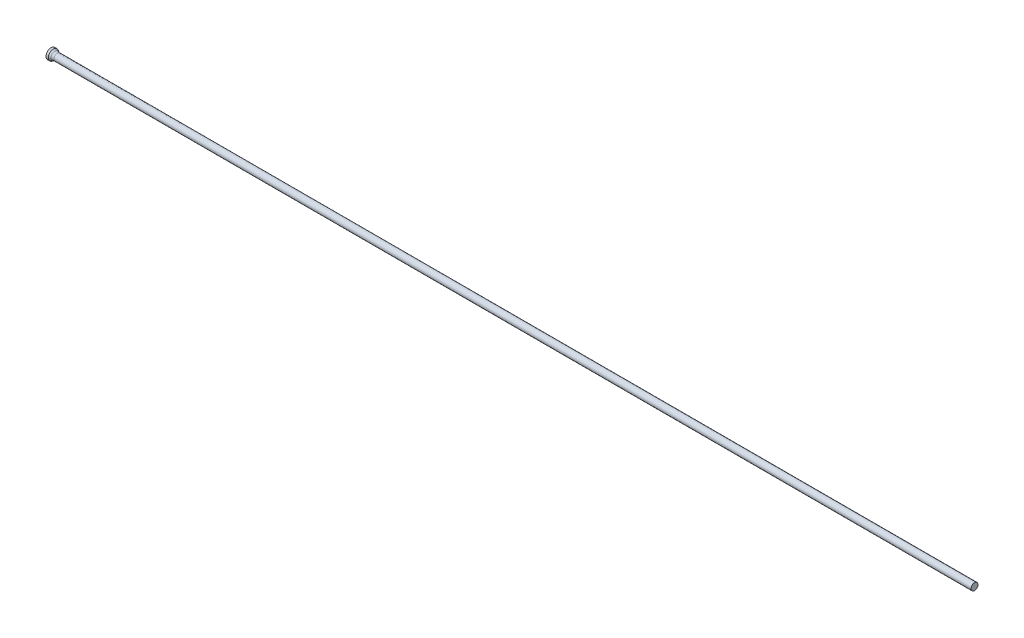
ISO-10303-21;
HEADER;
FILE_DESCRIPTION(('STEP AP214'),'2;1');
FILE_NAME('part.step','',(''),(''),'','','');
FILE_SCHEMA(('AUTOMOTIVE_DESIGN { 1 0 10303 214 1 1 1 1 }'));
ENDSEC;
DATA;
#1=APPLICATION_CONTEXT('core data for automotive mechanical design processes');
#2=APPLICATION_PROTOCOL_DEFINITION('international standard','automotive_design',2000,#1);
#3=PRODUCT_CONTEXT('',#1,'mechanical');
#4=PRODUCT('Part','Part','',(#3));
#5=PRODUCT_RELATED_PRODUCT_CATEGORY('part','',(#4));
#6=PRODUCT_DEFINITION_FORMATION('','',#4);
#7=PRODUCT_DEFINITION_CONTEXT('part definition',#1,'design');
#8=PRODUCT_DEFINITION('design','',#6,#7);
#9=PRODUCT_DEFINITION_SHAPE('','',#8);
#10=(LENGTH_UNIT() NAMED_UNIT(*) SI_UNIT(.MILLI.,.METRE.));
#11=(NAMED_UNIT(*) PLANE_ANGLE_UNIT() SI_UNIT($,.RADIAN.));
#12=(NAMED_UNIT(*) SI_UNIT($,.STERADIAN.) SOLID_ANGLE_UNIT());
#13=UNCERTAINTY_MEASURE_WITH_UNIT(LENGTH_MEASURE(1.E-05),#10,'distance_accuracy_value','');
#14=(GEOMETRIC_REPRESENTATION_CONTEXT(3) GLOBAL_UNCERTAINTY_ASSIGNED_CONTEXT((#13)) GLOBAL_UNIT_ASSIGNED_CONTEXT((#10,
#11,#12)) REPRESENTATION_CONTEXT('',''));
#15=CARTESIAN_POINT('',(0.,0.,0.));
#16=DIRECTION('',(0.,0.,1.));
#17=DIRECTION('',(1.,0.,0.));
#18=AXIS2_PLACEMENT_3D('',#15,#16,#17);
#19=CARTESIAN_POINT('',(0.,0.,0.));
#20=DIRECTION('',(1.,0.,0.));
#21=DIRECTION('',(0.,0.,-1.));
#22=AXIS2_PLACEMENT_3D('',#19,#20,#21);
#23=PLANE('',#22);
#24=CARTESIAN_POINT('',(0.,0.,0.));
#25=DIRECTION('',(-1.,0.,0.));
#26=DIRECTION('',(0.,0.,1.));
#27=AXIS2_PLACEMENT_3D('',#24,#25,#26);
#28=CIRCLE('',#27,1.1);
#29=CARTESIAN_POINT('',(0.,0.,1.1));
#30=VERTEX_POINT('',#29);
#31=EDGE_CURVE('E25',#30,#30,#28,.T.);
#32=ORIENTED_EDGE('',*,*,#31,.T.);
#33=EDGE_LOOP('',(#32));
#34=FACE_BOUND('',#33,.T.);
#35=ADVANCED_FACE('F14',(#34),#23,.F.);
#36=CARTESIAN_POINT('',(0.,0.,0.));
#37=DIRECTION('',(-1.,0.,0.));
#38=DIRECTION('',(0.,0.,1.));
#39=AXIS2_PLACEMENT_3D('',#36,#37,#38);
#40=CYLINDRICAL_SURFACE('',#39,1.1);
#41=ORIENTED_EDGE('',*,*,#31,.F.);
#42=EDGE_LOOP('',(#41));
#43=FACE_BOUND('',#42,.T.);
#44=CARTESIAN_POINT('',(0.503782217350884,0.,0.));
#45=DIRECTION('',(-1.,0.,0.));
#46=DIRECTION('',(0.,0.,1.));
#47=AXIS2_PLACEMENT_3D('',#44,#45,#46);
#48=CIRCLE('',#47,1.1);
#49=CARTESIAN_POINT('',(0.503782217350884,0.,1.1));
#50=VERTEX_POINT('',#49);
#51=EDGE_CURVE('E29',#50,#50,#48,.T.);
#52=ORIENTED_EDGE('',*,*,#51,.T.);
#53=EDGE_LOOP('',(#52));
#54=FACE_BOUND('',#53,.T.);
#55=ADVANCED_FACE('F53',(#43,#54),#40,.T.);
#56=CARTESIAN_POINT('',(1.11,0.,0.));
#57=DIRECTION('',(-1.,0.,0.));
#58=DIRECTION('',(0.,0.,1.));
#59=AXIS2_PLACEMENT_3D('',#56,#57,#58);
#60=CONICAL_SURFACE('',#59,0.75,0.523598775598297);
#61=CARTESIAN_POINT('',(0.877949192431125,0.,0.));
#62=DIRECTION('',(-1.,0.,0.));
#63=DIRECTION('',(0.,0.,1.));
#64=AXIS2_PLACEMENT_3D('',#61,#62,#63);
#65=CIRCLE('',#64,0.883974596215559);
#66=CARTESIAN_POINT('',(0.877949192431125,0.,0.883974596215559));
#67=VERTEX_POINT('',#66);
#68=EDGE_CURVE('E21',#67,#67,#65,.T.);
#69=ORIENTED_EDGE('',*,*,#68,.T.);
#70=EDGE_LOOP('',(#69));
#71=FACE_BOUND('',#70,.T.);
#72=ORIENTED_EDGE('',*,*,#51,.F.);
#73=EDGE_LOOP('',(#72));
#74=FACE_BOUND('',#73,.T.);
#75=ADVANCED_FACE('F50',(#71,#74),#60,.T.);
#76=CARTESIAN_POINT('',(0.,0.,0.));
#77=DIRECTION('',(-1.,0.,0.));
#78=DIRECTION('',(0.,0.,1.));
#79=AXIS2_PLACEMENT_3D('',#76,#77,#78);
#80=CYLINDRICAL_SURFACE('',#79,0.75);
#81=CARTESIAN_POINT('',(1.37794919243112,0.,0.));
#82=DIRECTION('',(-1.,0.,0.));
#83=DIRECTION('',(0.,0.,1.));
#84=AXIS2_PLACEMENT_3D('',#81,#82,#83);
#85=CIRCLE('',#84,0.75);
#86=CARTESIAN_POINT('',(1.37794919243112,0.,0.75));
#87=VERTEX_POINT('',#86);
#88=EDGE_CURVE('E9',#87,#87,#85,.F.);
#89=ORIENTED_EDGE('',*,*,#88,.T.);
#90=EDGE_LOOP('',(#89));
#91=FACE_BOUND('',#90,.T.);
#92=CARTESIAN_POINT('',(200.,0.,0.));
#93=DIRECTION('',(-1.,0.,0.));
#94=DIRECTION('',(0.,0.,1.));
#95=AXIS2_PLACEMENT_3D('',#92,#93,#94);
#96=CIRCLE('',#95,0.75);
#97=CARTESIAN_POINT('',(200.,0.,0.75));
#98=VERTEX_POINT('',#97);
#99=EDGE_CURVE('E34',#98,#98,#96,.T.);
#100=ORIENTED_EDGE('',*,*,#99,.T.);
#101=EDGE_LOOP('',(#100));
#102=FACE_BOUND('',#101,.T.);
#103=ADVANCED_FACE('F38',(#91,#102),#80,.T.);
#104=CARTESIAN_POINT('',(200.,0.75,0.));
#105=DIRECTION('',(-1.,0.,0.));
#106=DIRECTION('',(0.,0.,1.));
#107=AXIS2_PLACEMENT_3D('',#104,#105,#106);
#108=PLANE('',#107);
#109=ORIENTED_EDGE('',*,*,#99,.F.);
#110=EDGE_LOOP('',(#109));
#111=FACE_BOUND('',#110,.T.);
#112=ADVANCED_FACE('F40',(#111),#108,.F.);
#113=CARTESIAN_POINT('',(1.37794919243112,0.,0.));
#114=DIRECTION('',(-1.,0.,0.));
#115=DIRECTION('',(0.,0.,1.));
#116=AXIS2_PLACEMENT_3D('',#113,#114,#115);
#117=TOROIDAL_SURFACE('',#116,1.75,1.);
#118=ORIENTED_EDGE('',*,*,#88,.F.);
#119=EDGE_LOOP('',(#118));
#120=FACE_BOUND('',#119,.T.);
#121=ORIENTED_EDGE('',*,*,#68,.F.);
#122=EDGE_LOOP('',(#121));
#123=FACE_BOUND('',#122,.T.);
#124=ADVANCED_FACE('F16',(#120,#123),#117,.F.);
#125=CLOSED_SHELL('',(#35,#55,#75,#103,#112,#124));
#126=MANIFOLD_SOLID_BREP('B1',#125);
#127=ADVANCED_BREP_SHAPE_REPRESENTATION('',(#18,#126),#14);
#128=SHAPE_DEFINITION_REPRESENTATION(#9,#127);
ENDSEC;
END-ISO-10303-21;
